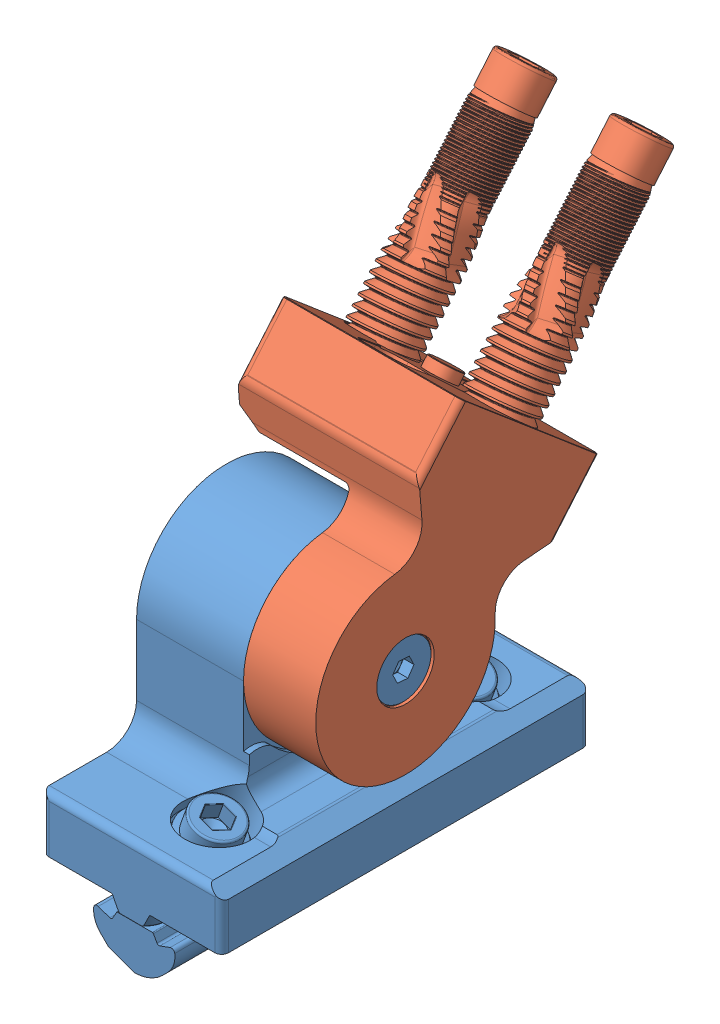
SolidWorks assembly 40mm Pivot Bracket Profile to End Mount Kit.SLDASM, configuration Standard (file format 13000). Lengths in mm.
Overall size (39.5 128.74 113.74).
2 component instances, 2 part files, 2 mates.
Components (placement in the parent):
- 40mm Pivot Bracket Profile Mount Bearing Side-1: 40mm Pivot Bracket Profile Mount Bearing Side.SLDPRT [Standard] at (-23.8402 1.1012 15.3031) size (39.27 66.24 80)
- 40mm Pivot Bracket End Mount Axle Side-1: 40mm Pivot Bracket End Mount Axle Side.SLDPRT [Standard] at (-117.3506 15.6325 12.9205) x (-1 0 0) z (0 0.646482 0.76293) size (39.5 110.25 39.5)
Mates (geometry in assembly coordinates):
- Concentric1: concentric: cylinder of 40mm Pivot Bracket Profile Mount Bearing Side-1 through (-43.6943 0.4938 43.893) axis (1 0 0) radius 5.9817; cylinder of 40mm Pivot Bracket End Mount Axle Side-1 through (-46.4003 0.4938 43.893) axis (1 0 0) radius 6
- Coincident1: coincident anti-aligned: plane of 40mm Pivot Bracket Profile Mount Bearing Side-1 through (-62.4003 -18.7562 61.7396) normal (1 0 0); plane of 40mm Pivot Bracket End Mount Axle Side-1 through (-62.4003 13.4235 59.1516) normal (-1 0 0)
